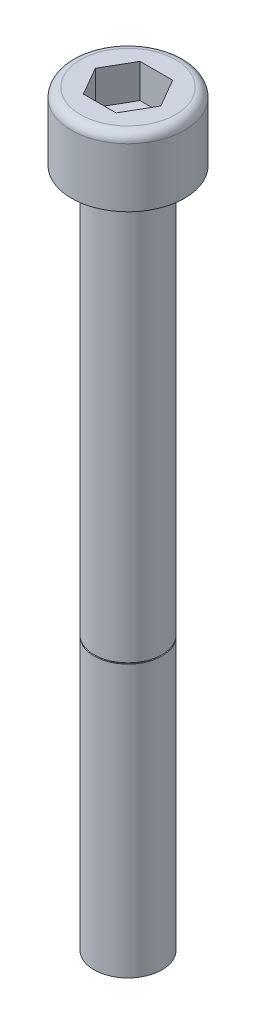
from build123d import *

# Parameters (mm, degrees)
SCHNITT_LINEAR_AUSTRAGEN1_DEPTH = 3


with BuildPart() as part:
    # Skizze1 → Rotation1 (revolve)
    with BuildSketch(Plane.XY, mode=Mode.PRIVATE) as rotation1_sk:
        with BuildLine():
            Line((0, 0), (-3, 0))
            Line((-3, 0), (-3, 24))
            Line((-3, 24), (-2.9, 24))
            Line((-2.9, 24), (-2.9, 24.1))
            Line((-2.9, 24.1), (-3, 24.1))
            Line((-3, 24.1), (-3, 60))
            Line((-3, 60), (-5, 60))
            Line((-5, 60), (-5, 65.2))
            ThreePointArc((-5, 65.2), (-4.765685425, 65.765685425), (-4.2, 66))
            Line((-4.2, 66), (0, 66))
            Line((0, 66), (0, 0))
        make_face()
    revolve(rotation1_sk.sketch.rotate(Axis((0, 0, 0), (0, 1, 0)), 270), axis=Axis((0, 0, 0), (0, 1, 0)))

    # Skizze2 → Schnitt-Linear austragen1 (cut)
    with BuildSketch(Plane(origin=(0, 66, 0), x_dir=(1, 0, 0), z_dir=(0, 1, 0))):
        Polygon((1.443375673, 2.5), (-1.443375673, 2.5), (-2.886751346, 0), (-1.443375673, -2.5), (1.443375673, -2.5), (2.886751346, 0), align=None)
    extrude(amount=-SCHNITT_LINEAR_AUSTRAGEN1_DEPTH, mode=Mode.SUBTRACT)


solid = part.part
